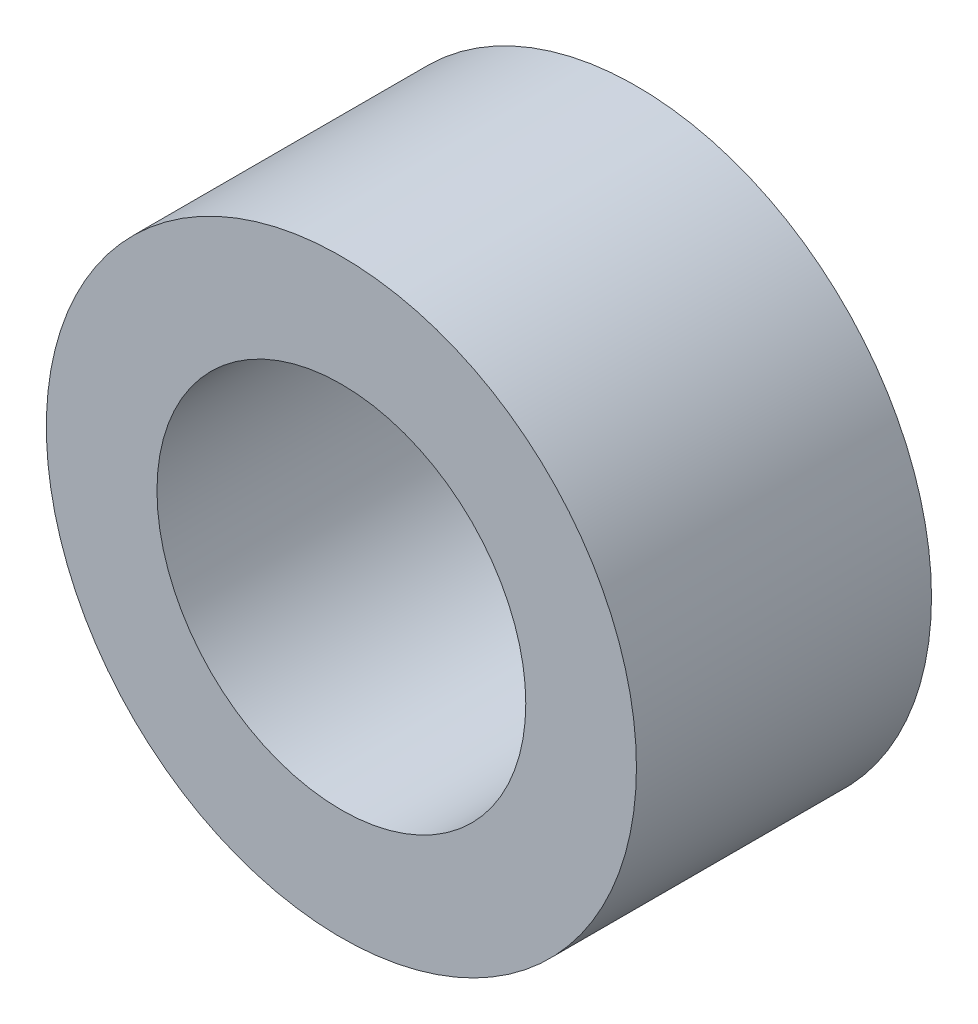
from build123d import *

# Parameters (mm, degrees)
ESQUISSE1_R        = 4
ESQUISSE1_R_2      = 2.5
BOSS_EXTRU_1_DEPTH = 4


with BuildPart() as part:
    # Esquisse1 → Boss.-Extru.1 (new body)
    with BuildSketch(Plane.XY):
        Circle(ESQUISSE1_R)
        Circle(ESQUISSE1_R_2, mode=Mode.SUBTRACT)
    extrude(amount=BOSS_EXTRU_1_DEPTH)


solid = part.part
